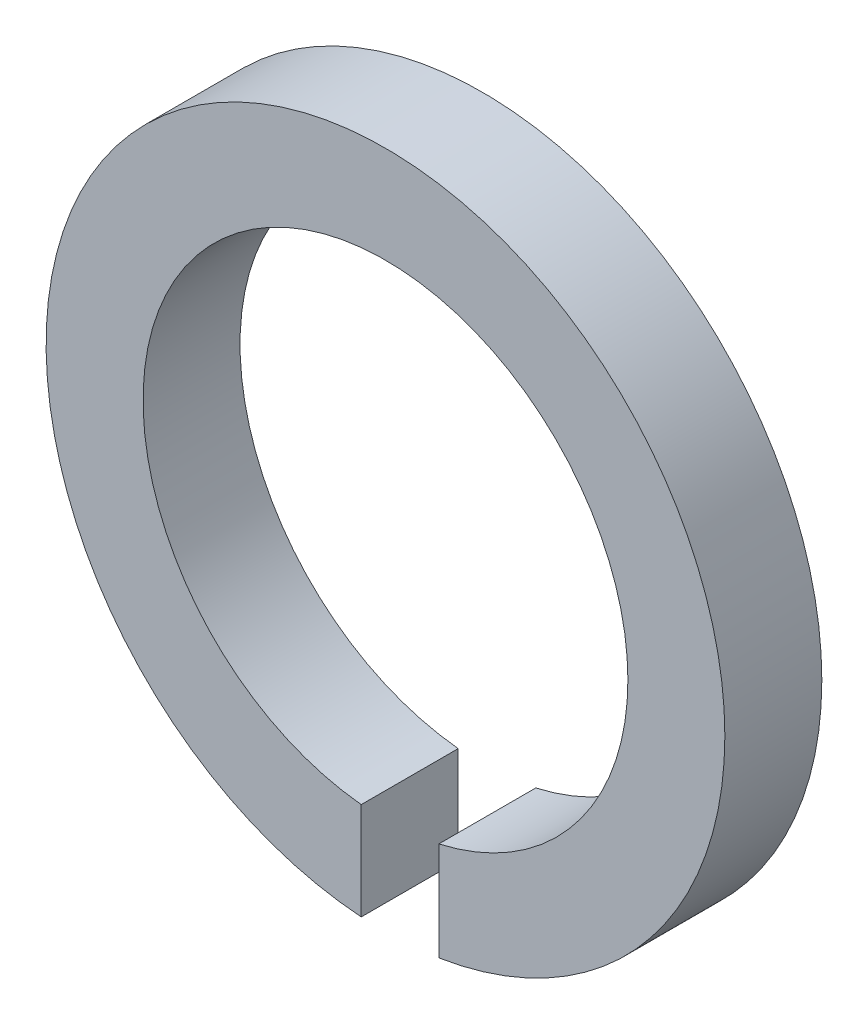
ISO-10303-21;
HEADER;
FILE_DESCRIPTION(('STEP AP214'),'2;1');
FILE_NAME('part.step','',(''),(''),'','','');
FILE_SCHEMA(('AUTOMOTIVE_DESIGN { 1 0 10303 214 1 1 1 1 }'));
ENDSEC;
DATA;
#1=APPLICATION_CONTEXT('core data for automotive mechanical design processes');
#2=APPLICATION_PROTOCOL_DEFINITION('international standard','automotive_design',2000,#1);
#3=PRODUCT_CONTEXT('',#1,'mechanical');
#4=PRODUCT('Part','Part','',(#3));
#5=PRODUCT_RELATED_PRODUCT_CATEGORY('part','',(#4));
#6=PRODUCT_DEFINITION_FORMATION('','',#4);
#7=PRODUCT_DEFINITION_CONTEXT('part definition',#1,'design');
#8=PRODUCT_DEFINITION('design','',#6,#7);
#9=PRODUCT_DEFINITION_SHAPE('','',#8);
#10=(LENGTH_UNIT() NAMED_UNIT(*) SI_UNIT(.MILLI.,.METRE.));
#11=(NAMED_UNIT(*) PLANE_ANGLE_UNIT() SI_UNIT($,.RADIAN.));
#12=(NAMED_UNIT(*) SI_UNIT($,.STERADIAN.) SOLID_ANGLE_UNIT());
#13=UNCERTAINTY_MEASURE_WITH_UNIT(LENGTH_MEASURE(1.E-05),#10,'distance_accuracy_value','');
#14=(GEOMETRIC_REPRESENTATION_CONTEXT(3) GLOBAL_UNCERTAINTY_ASSIGNED_CONTEXT((#13)) GLOBAL_UNIT_ASSIGNED_CONTEXT((#10,
#11,#12)) REPRESENTATION_CONTEXT('',''));
#15=CARTESIAN_POINT('',(0.,0.,0.));
#16=DIRECTION('',(0.,0.,1.));
#17=DIRECTION('',(1.,0.,0.));
#18=AXIS2_PLACEMENT_3D('',#15,#16,#17);
#19=CARTESIAN_POINT('',(0.,0.,-0.6));
#20=DIRECTION('',(0.,0.,1.));
#21=DIRECTION('',(1.,0.,0.));
#22=AXIS2_PLACEMENT_3D('',#19,#20,#21);
#23=CYLINDRICAL_SURFACE('',#22,2.1);
#24=DIRECTION('',(0.,0.,1.));
#25=VECTOR('',#24,1.);
#26=CARTESIAN_POINT('',(-0.15,-2.09463600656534,-0.6));
#27=LINE('',#26,#25);
#28=CARTESIAN_POINT('',(-0.15,-2.09463600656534,0.));
#29=VERTEX_POINT('',#28);
#30=CARTESIAN_POINT('',(-0.15,-2.09463600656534,-0.6));
#31=VERTEX_POINT('',#30);
#32=EDGE_CURVE('E73',#29,#31,#27,.F.);
#33=ORIENTED_EDGE('',*,*,#32,.F.);
#34=CARTESIAN_POINT('',(0.,0.,0.));
#35=DIRECTION('',(0.,0.,1.));
#36=DIRECTION('',(1.,0.,0.));
#37=AXIS2_PLACEMENT_3D('',#34,#35,#36);
#38=CIRCLE('',#37,2.1);
#39=CARTESIAN_POINT('',(0.33,-2.07390935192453,0.));
#40=VERTEX_POINT('',#39);
#41=EDGE_CURVE('E83',#40,#29,#38,.T.);
#42=ORIENTED_EDGE('',*,*,#41,.F.);
#43=DIRECTION('',(0.,0.,1.));
#44=VECTOR('',#43,1.);
#45=CARTESIAN_POINT('',(0.33,-2.07390935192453,-0.6));
#46=LINE('',#45,#44);
#47=CARTESIAN_POINT('',(0.33,-2.07390935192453,-0.6));
#48=VERTEX_POINT('',#47);
#49=EDGE_CURVE('E87',#48,#40,#46,.T.);
#50=ORIENTED_EDGE('',*,*,#49,.F.);
#51=CARTESIAN_POINT('',(0.,0.,-0.6));
#52=DIRECTION('',(0.,0.,1.));
#53=DIRECTION('',(1.,0.,0.));
#54=AXIS2_PLACEMENT_3D('',#51,#52,#53);
#55=CIRCLE('',#54,2.1);
#56=EDGE_CURVE('E85',#48,#31,#55,.T.);
#57=ORIENTED_EDGE('',*,*,#56,.T.);
#58=EDGE_LOOP('',(#33,#42,#50,#57));
#59=FACE_BOUND('',#58,.T.);
#60=ADVANCED_FACE('F33',(#59),#23,.T.);
#61=CARTESIAN_POINT('',(0.,0.,-0.6));
#62=DIRECTION('',(0.,0.,1.));
#63=DIRECTION('',(1.,0.,0.));
#64=AXIS2_PLACEMENT_3D('',#61,#62,#63);
#65=PLANE('',#64);
#66=CARTESIAN_POINT('',(0.,0.,-0.6));
#67=DIRECTION('',(0.,0.,1.));
#68=DIRECTION('',(1.,0.,0.));
#69=AXIS2_PLACEMENT_3D('',#66,#67,#68);
#70=CIRCLE('',#69,1.5);
#71=CARTESIAN_POINT('',(0.33,-1.46324980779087,-0.6));
#72=VERTEX_POINT('',#71);
#73=CARTESIAN_POINT('',(-0.15,-1.49248115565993,-0.6));
#74=VERTEX_POINT('',#73);
#75=EDGE_CURVE('E90',#72,#74,#70,.T.);
#76=ORIENTED_EDGE('',*,*,#75,.T.);
#77=DIRECTION('',(0.,1.,0.));
#78=VECTOR('',#77,1.);
#79=CARTESIAN_POINT('',(-0.15,-2.1,-0.6));
#80=LINE('',#79,#78);
#81=EDGE_CURVE('E55',#31,#74,#80,.T.);
#82=ORIENTED_EDGE('',*,*,#81,.F.);
#83=ORIENTED_EDGE('',*,*,#56,.F.);
#84=DIRECTION('',(0.,1.,0.));
#85=VECTOR('',#84,1.);
#86=CARTESIAN_POINT('',(0.33,-2.1,-0.6));
#87=LINE('',#86,#85);
#88=EDGE_CURVE('E103',#48,#72,#87,.T.);
#89=ORIENTED_EDGE('',*,*,#88,.T.);
#90=EDGE_LOOP('',(#76,#82,#83,#89));
#91=FACE_BOUND('',#90,.T.);
#92=ADVANCED_FACE('F106',(#91),#65,.F.);
#93=CARTESIAN_POINT('',(0.,0.,0.));
#94=DIRECTION('',(0.,0.,1.));
#95=DIRECTION('',(1.,0.,0.));
#96=AXIS2_PLACEMENT_3D('',#93,#94,#95);
#97=PLANE('',#96);
#98=DIRECTION('',(0.,1.,0.));
#99=VECTOR('',#98,1.);
#100=CARTESIAN_POINT('',(-0.15,-2.1,0.));
#101=LINE('',#100,#99);
#102=CARTESIAN_POINT('',(-0.15,-1.49248115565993,0.));
#103=VERTEX_POINT('',#102);
#104=EDGE_CURVE('E70',#29,#103,#101,.T.);
#105=ORIENTED_EDGE('',*,*,#104,.T.);
#106=CARTESIAN_POINT('',(0.,0.,0.));
#107=DIRECTION('',(0.,0.,1.));
#108=DIRECTION('',(1.,0.,0.));
#109=AXIS2_PLACEMENT_3D('',#106,#107,#108);
#110=CIRCLE('',#109,1.5);
#111=CARTESIAN_POINT('',(0.33,-1.46324980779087,0.));
#112=VERTEX_POINT('',#111);
#113=EDGE_CURVE('E86',#112,#103,#110,.T.);
#114=ORIENTED_EDGE('',*,*,#113,.F.);
#115=DIRECTION('',(0.,1.,0.));
#116=VECTOR('',#115,1.);
#117=CARTESIAN_POINT('',(0.33,-2.1,0.));
#118=LINE('',#117,#116);
#119=EDGE_CURVE('E47',#40,#112,#118,.T.);
#120=ORIENTED_EDGE('',*,*,#119,.F.);
#121=ORIENTED_EDGE('',*,*,#41,.T.);
#122=EDGE_LOOP('',(#105,#114,#120,#121));
#123=FACE_BOUND('',#122,.T.);
#124=ADVANCED_FACE('F89',(#123),#97,.T.);
#125=CARTESIAN_POINT('',(0.,0.,-0.6));
#126=DIRECTION('',(0.,0.,1.));
#127=DIRECTION('',(1.,0.,0.));
#128=AXIS2_PLACEMENT_3D('',#125,#126,#127);
#129=CYLINDRICAL_SURFACE('',#128,1.5);
#130=ORIENTED_EDGE('',*,*,#113,.T.);
#131=DIRECTION('',(0.,0.,1.));
#132=VECTOR('',#131,1.);
#133=CARTESIAN_POINT('',(-0.15,-1.49248115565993,-0.6));
#134=LINE('',#133,#132);
#135=EDGE_CURVE('E11',#103,#74,#134,.F.);
#136=ORIENTED_EDGE('',*,*,#135,.T.);
#137=ORIENTED_EDGE('',*,*,#75,.F.);
#138=DIRECTION('',(0.,0.,1.));
#139=VECTOR('',#138,1.);
#140=CARTESIAN_POINT('',(0.33,-1.46324980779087,-0.6));
#141=LINE('',#140,#139);
#142=EDGE_CURVE('E40',#72,#112,#141,.T.);
#143=ORIENTED_EDGE('',*,*,#142,.T.);
#144=EDGE_LOOP('',(#130,#136,#137,#143));
#145=FACE_BOUND('',#144,.T.);
#146=ADVANCED_FACE('F98',(#145),#129,.F.);
#147=CARTESIAN_POINT('',(0.33,-2.1,-0.6));
#148=DIRECTION('',(1.,0.,0.));
#149=DIRECTION('',(0.,0.,-1.));
#150=AXIS2_PLACEMENT_3D('',#147,#148,#149);
#151=PLANE('',#150);
#152=ORIENTED_EDGE('',*,*,#49,.T.);
#153=ORIENTED_EDGE('',*,*,#119,.T.);
#154=ORIENTED_EDGE('',*,*,#142,.F.);
#155=ORIENTED_EDGE('',*,*,#88,.F.);
#156=EDGE_LOOP('',(#152,#153,#154,#155));
#157=FACE_BOUND('',#156,.T.);
#158=ADVANCED_FACE('F107',(#157),#151,.F.);
#159=CARTESIAN_POINT('',(-0.15,-2.1,-0.6));
#160=DIRECTION('',(-1.,0.,0.));
#161=DIRECTION('',(0.,0.,1.));
#162=AXIS2_PLACEMENT_3D('',#159,#160,#161);
#163=PLANE('',#162);
#164=ORIENTED_EDGE('',*,*,#32,.T.);
#165=ORIENTED_EDGE('',*,*,#81,.T.);
#166=ORIENTED_EDGE('',*,*,#135,.F.);
#167=ORIENTED_EDGE('',*,*,#104,.F.);
#168=EDGE_LOOP('',(#164,#165,#166,#167));
#169=FACE_BOUND('',#168,.T.);
#170=ADVANCED_FACE('F72',(#169),#163,.F.);
#171=CLOSED_SHELL('',(#60,#92,#124,#146,#158,#170));
#172=MANIFOLD_SOLID_BREP('B2',#171);
#173=ADVANCED_BREP_SHAPE_REPRESENTATION('',(#18,#172),#14);
#174=SHAPE_DEFINITION_REPRESENTATION(#9,#173);
ENDSEC;
END-ISO-10303-21;
